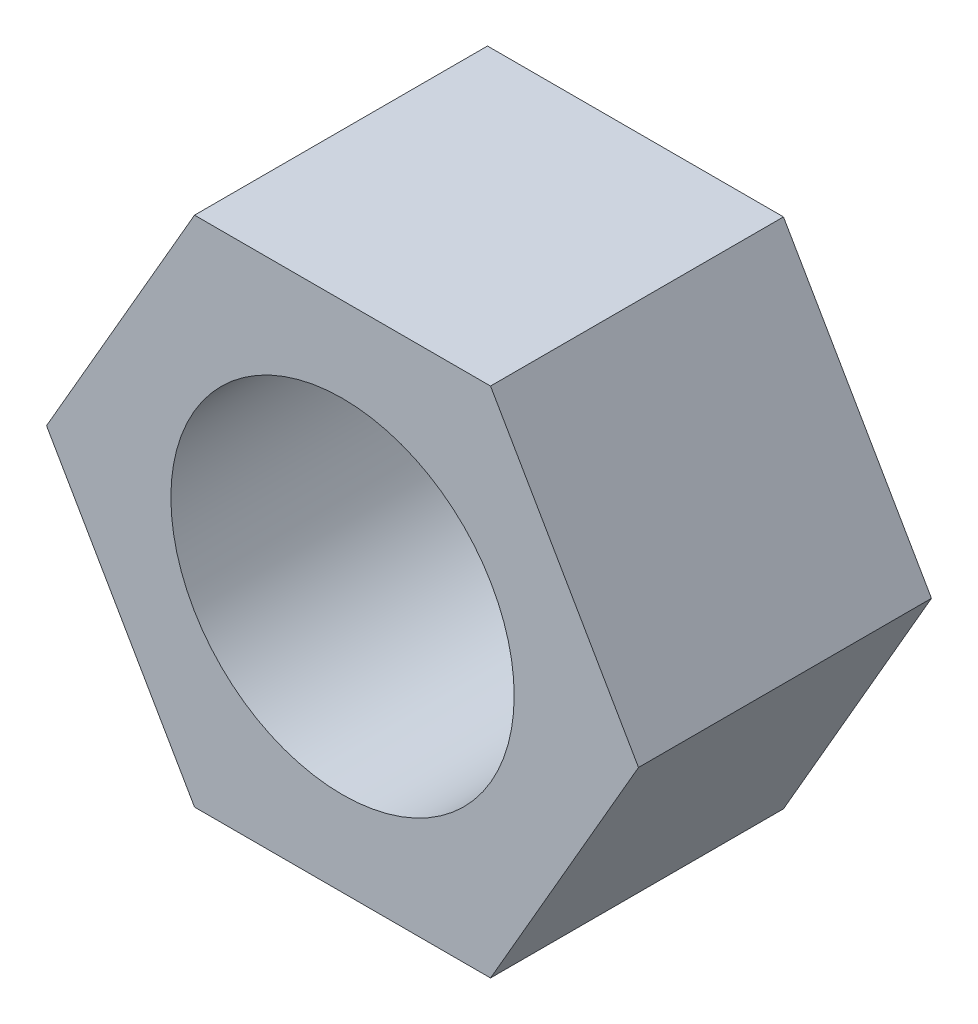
from build123d import *

# Parameters (mm, degrees)
SKETCH1_R      = 9.525
EXTRUDE1_DEPTH = 16.256


with BuildPart() as part:
    # Sketch1 → Extrude1 (new body)
    with BuildSketch(Plane.XY):
        Polygon((-16.424460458, 0), (-8.212230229, -14.224), (8.212230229, -14.224), (16.424460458, 0), (8.212230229, 14.224), (-8.212230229, 14.224), align=None)
        Circle(SKETCH1_R, mode=Mode.SUBTRACT)
    extrude(amount=EXTRUDE1_DEPTH)


solid = part.part
